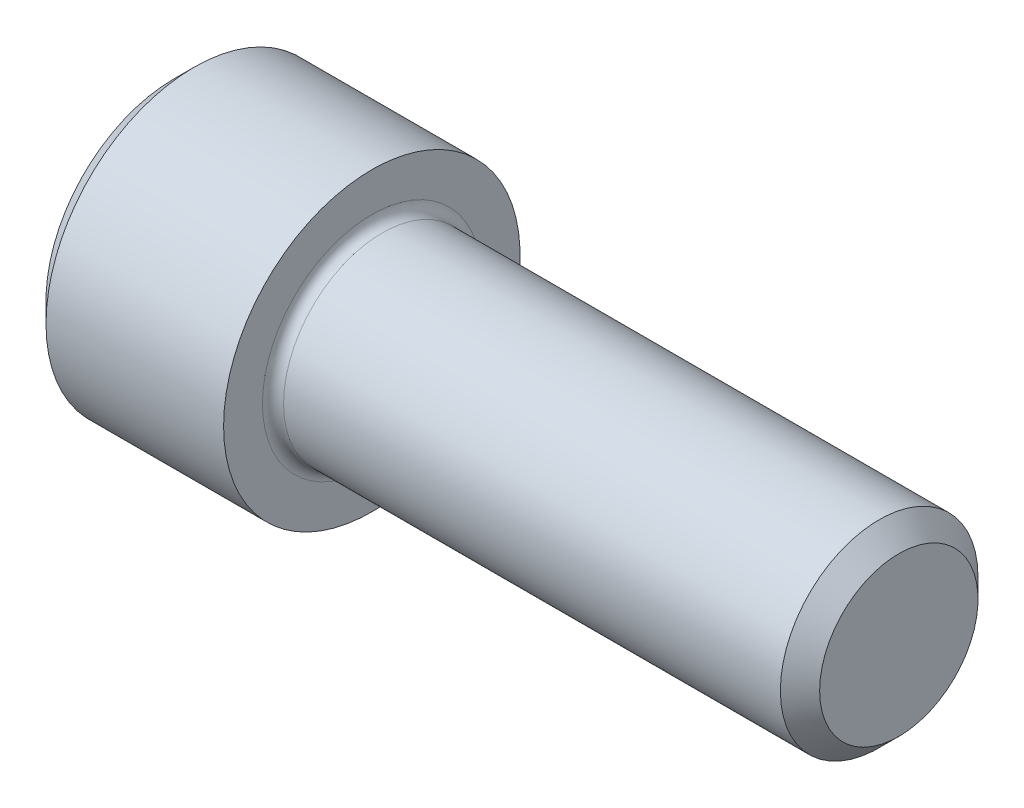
ISO-10303-21;
HEADER;
FILE_DESCRIPTION(('STEP AP214'),'2;1');
FILE_NAME('part.step','',(''),(''),'','','');
FILE_SCHEMA(('AUTOMOTIVE_DESIGN { 1 0 10303 214 1 1 1 1 }'));
ENDSEC;
DATA;
#1=APPLICATION_CONTEXT('core data for automotive mechanical design processes');
#2=APPLICATION_PROTOCOL_DEFINITION('international standard','automotive_design',2000,#1);
#3=PRODUCT_CONTEXT('',#1,'mechanical');
#4=PRODUCT('Part','Part','',(#3));
#5=PRODUCT_RELATED_PRODUCT_CATEGORY('part','',(#4));
#6=PRODUCT_DEFINITION_FORMATION('','',#4);
#7=PRODUCT_DEFINITION_CONTEXT('part definition',#1,'design');
#8=PRODUCT_DEFINITION('design','',#6,#7);
#9=PRODUCT_DEFINITION_SHAPE('','',#8);
#10=(LENGTH_UNIT() NAMED_UNIT(*) SI_UNIT(.MILLI.,.METRE.));
#11=(NAMED_UNIT(*) PLANE_ANGLE_UNIT() SI_UNIT($,.RADIAN.));
#12=(NAMED_UNIT(*) SI_UNIT($,.STERADIAN.) SOLID_ANGLE_UNIT());
#13=UNCERTAINTY_MEASURE_WITH_UNIT(LENGTH_MEASURE(1.E-05),#10,'distance_accuracy_value','');
#14=(GEOMETRIC_REPRESENTATION_CONTEXT(3) GLOBAL_UNCERTAINTY_ASSIGNED_CONTEXT((#13)) GLOBAL_UNIT_ASSIGNED_CONTEXT((#10,
#11,#12)) REPRESENTATION_CONTEXT('',''));
#15=CARTESIAN_POINT('',(0.,0.,0.));
#16=DIRECTION('',(0.,0.,1.));
#17=DIRECTION('',(1.,0.,0.));
#18=AXIS2_PLACEMENT_3D('',#15,#16,#17);
#19=CARTESIAN_POINT('',(4.62279999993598,0.,0.));
#20=DIRECTION('',(-1.,0.,0.));
#21=DIRECTION('',(0.,0.,1.));
#22=AXIS2_PLACEMENT_3D('',#19,#20,#21);
#23=CONICAL_SURFACE('',#22,3.96875000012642,1.047197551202);
#24=CARTESIAN_POINT('',(6.91415888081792,0.,0.));
#25=VERTEX_POINT('',#24);
#26=VERTEX_LOOP('',#25);
#27=FACE_BOUND('',#26,.T.);
#28=CARTESIAN_POINT('',(4.62280000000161,0.,0.));
#29=DIRECTION('',(-1.,0.,0.));
#30=DIRECTION('',(0.,0.,1.));
#31=AXIS2_PLACEMENT_3D('',#28,#29,#30);
#32=CIRCLE('',#31,3.96875000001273);
#33=CARTESIAN_POINT('',(4.6227999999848,0.,3.9687500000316));
#34=VERTEX_POINT('',#33);
#35=CARTESIAN_POINT('',(4.62280000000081,-3.437038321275,1.98437500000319));
#36=VERTEX_POINT('',#35);
#37=EDGE_CURVE('E99',#34,#36,#32,.F.);
#38=ORIENTED_EDGE('',*,*,#37,.F.);
#39=CARTESIAN_POINT('',(4.62280000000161,0.,0.));
#40=DIRECTION('',(-1.,0.,0.));
#41=DIRECTION('',(0.,0.,1.));
#42=AXIS2_PLACEMENT_3D('',#39,#40,#41);
#43=CIRCLE('',#42,3.96875000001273);
#44=CARTESIAN_POINT('',(4.62280000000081,3.43703832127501,1.98437500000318));
#45=VERTEX_POINT('',#44);
#46=EDGE_CURVE('E96',#45,#34,#43,.F.);
#47=ORIENTED_EDGE('',*,*,#46,.F.);
#48=CARTESIAN_POINT('',(4.62280000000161,0.,0.));
#49=DIRECTION('',(-1.,0.,0.));
#50=DIRECTION('',(0.,0.,1.));
#51=AXIS2_PLACEMENT_3D('',#48,#49,#50);
#52=CIRCLE('',#51,3.96875000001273);
#53=CARTESIAN_POINT('',(4.62280000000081,3.437038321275,-1.98437500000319));
#54=VERTEX_POINT('',#53);
#55=EDGE_CURVE('E157',#54,#45,#52,.F.);
#56=ORIENTED_EDGE('',*,*,#55,.F.);
#57=CARTESIAN_POINT('',(4.62280000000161,0.,0.));
#58=DIRECTION('',(-1.,0.,0.));
#59=DIRECTION('',(0.,0.,1.));
#60=AXIS2_PLACEMENT_3D('',#57,#58,#59);
#61=CIRCLE('',#60,3.96875000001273);
#62=CARTESIAN_POINT('',(4.6227999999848,2.58829427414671E-13,-3.96875000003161));
#63=VERTEX_POINT('',#62);
#64=EDGE_CURVE('E154',#63,#54,#61,.F.);
#65=ORIENTED_EDGE('',*,*,#64,.F.);
#66=CARTESIAN_POINT('',(4.62280000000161,0.,0.));
#67=DIRECTION('',(-1.,0.,0.));
#68=DIRECTION('',(0.,0.,1.));
#69=AXIS2_PLACEMENT_3D('',#66,#67,#68);
#70=CIRCLE('',#69,3.96875000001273);
#71=CARTESIAN_POINT('',(4.62280000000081,-3.43703832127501,-1.98437500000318));
#72=VERTEX_POINT('',#71);
#73=EDGE_CURVE('E159',#72,#63,#70,.F.);
#74=ORIENTED_EDGE('',*,*,#73,.F.);
#75=CARTESIAN_POINT('',(4.62280000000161,0.,0.));
#76=DIRECTION('',(-1.,0.,0.));
#77=DIRECTION('',(0.,0.,1.));
#78=AXIS2_PLACEMENT_3D('',#75,#76,#77);
#79=CIRCLE('',#78,3.96875000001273);
#80=EDGE_CURVE('E102',#36,#72,#79,.F.);
#81=ORIENTED_EDGE('',*,*,#80,.F.);
#82=EDGE_LOOP('',(#38,#47,#56,#65,#74,#81));
#83=FACE_BOUND('',#82,.T.);
#84=ADVANCED_FACE('F17',(#27,#83),#23,.F.);
#85=CARTESIAN_POINT('',(4.6228,2.29135888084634,3.96874999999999));
#86=DIRECTION('',(-1.,0.,0.));
#87=DIRECTION('',(0.,0.,1.));
#88=AXIS2_PLACEMENT_3D('',#85,#86,#87);
#89=PLANE('',#88);
#90=DIRECTION('',(0.,-1.,0.));
#91=VECTOR('',#90,1.);
#92=CARTESIAN_POINT('',(4.6228,-2.29135888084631,3.96875));
#93=LINE('',#92,#91);
#94=CARTESIAN_POINT('',(4.6228,2.29135888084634,3.96874999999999));
#95=VERTEX_POINT('',#94);
#96=EDGE_CURVE('E114',#34,#95,#93,.F.);
#97=ORIENTED_EDGE('',*,*,#96,.T.);
#98=DIRECTION('',(0.,0.499999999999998,-0.86602540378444));
#99=VECTOR('',#98,1.);
#100=CARTESIAN_POINT('',(4.6228,4.58271776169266,0.));
#101=LINE('',#100,#99);
#102=EDGE_CURVE('E115',#45,#95,#101,.F.);
#103=ORIENTED_EDGE('',*,*,#102,.F.);
#104=ORIENTED_EDGE('',*,*,#46,.T.);
#105=EDGE_LOOP('',(#97,#103,#104));
#106=FACE_BOUND('',#105,.T.);
#107=ADVANCED_FACE('F119',(#106),#89,.T.);
#108=CARTESIAN_POINT('',(4.6228,2.29135888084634,3.96874999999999));
#109=DIRECTION('',(-1.,0.,0.));
#110=DIRECTION('',(0.,0.,1.));
#111=AXIS2_PLACEMENT_3D('',#108,#109,#110);
#112=PLANE('',#111);
#113=DIRECTION('',(0.,0.500000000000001,0.866025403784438));
#114=VECTOR('',#113,1.);
#115=CARTESIAN_POINT('',(4.6228,-2.29135888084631,3.96875));
#116=LINE('',#115,#114);
#117=CARTESIAN_POINT('',(4.6228,-2.29135888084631,3.96875));
#118=VERTEX_POINT('',#117);
#119=EDGE_CURVE('E110',#118,#36,#116,.F.);
#120=ORIENTED_EDGE('',*,*,#119,.F.);
#121=DIRECTION('',(0.,-1.,0.));
#122=VECTOR('',#121,1.);
#123=CARTESIAN_POINT('',(4.6228,-2.29135888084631,3.96875));
#124=LINE('',#123,#122);
#125=EDGE_CURVE('E107',#118,#34,#124,.F.);
#126=ORIENTED_EDGE('',*,*,#125,.T.);
#127=ORIENTED_EDGE('',*,*,#37,.T.);
#128=EDGE_LOOP('',(#120,#126,#127));
#129=FACE_BOUND('',#128,.T.);
#130=ADVANCED_FACE('F108',(#129),#112,.T.);
#131=CARTESIAN_POINT('',(4.6228,2.29135888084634,3.96874999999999));
#132=DIRECTION('',(-1.,0.,0.));
#133=DIRECTION('',(0.,0.,1.));
#134=AXIS2_PLACEMENT_3D('',#131,#132,#133);
#135=PLANE('',#134);
#136=DIRECTION('',(0.,-0.499999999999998,0.86602540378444));
#137=VECTOR('',#136,1.);
#138=CARTESIAN_POINT('',(4.6228,-4.58271776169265,0.));
#139=LINE('',#138,#137);
#140=CARTESIAN_POINT('',(4.6228,-4.58271776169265,0.));
#141=VERTEX_POINT('',#140);
#142=EDGE_CURVE('E416',#141,#72,#139,.F.);
#143=ORIENTED_EDGE('',*,*,#142,.F.);
#144=DIRECTION('',(0.,0.500000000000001,0.866025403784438));
#145=VECTOR('',#144,1.);
#146=CARTESIAN_POINT('',(4.6228,-2.29135888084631,3.96875));
#147=LINE('',#146,#145);
#148=EDGE_CURVE('E418',#36,#141,#147,.F.);
#149=ORIENTED_EDGE('',*,*,#148,.F.);
#150=ORIENTED_EDGE('',*,*,#80,.T.);
#151=EDGE_LOOP('',(#143,#149,#150));
#152=FACE_BOUND('',#151,.T.);
#153=ADVANCED_FACE('F278',(#152),#135,.T.);
#154=CARTESIAN_POINT('',(4.6228,2.29135888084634,3.96874999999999));
#155=DIRECTION('',(-1.,0.,0.));
#156=DIRECTION('',(0.,0.,1.));
#157=AXIS2_PLACEMENT_3D('',#154,#155,#156);
#158=PLANE('',#157);
#159=DIRECTION('',(0.,1.,0.));
#160=VECTOR('',#159,1.);
#161=CARTESIAN_POINT('',(4.6228,2.29135888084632,-3.96875000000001));
#162=LINE('',#161,#160);
#163=CARTESIAN_POINT('',(4.6228,-2.29135888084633,-3.96875));
#164=VERTEX_POINT('',#163);
#165=EDGE_CURVE('E472',#63,#164,#162,.F.);
#166=ORIENTED_EDGE('',*,*,#165,.T.);
#167=DIRECTION('',(0.,-0.499999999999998,0.86602540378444));
#168=VECTOR('',#167,1.);
#169=CARTESIAN_POINT('',(4.6228,-4.58271776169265,0.));
#170=LINE('',#169,#168);
#171=EDGE_CURVE('E421',#72,#164,#170,.F.);
#172=ORIENTED_EDGE('',*,*,#171,.F.);
#173=ORIENTED_EDGE('',*,*,#73,.T.);
#174=EDGE_LOOP('',(#166,#172,#173));
#175=FACE_BOUND('',#174,.T.);
#176=ADVANCED_FACE('F274',(#175),#158,.T.);
#177=CARTESIAN_POINT('',(4.6228,2.29135888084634,3.96874999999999));
#178=DIRECTION('',(-1.,0.,0.));
#179=DIRECTION('',(0.,0.,1.));
#180=AXIS2_PLACEMENT_3D('',#177,#178,#179);
#181=PLANE('',#180);
#182=DIRECTION('',(0.,0.499999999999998,-0.86602540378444));
#183=VECTOR('',#182,1.);
#184=CARTESIAN_POINT('',(4.6228,4.58271776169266,0.));
#185=LINE('',#184,#183);
#186=CARTESIAN_POINT('',(4.6228,4.58271776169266,0.));
#187=VERTEX_POINT('',#186);
#188=EDGE_CURVE('E137',#187,#45,#185,.F.);
#189=ORIENTED_EDGE('',*,*,#188,.F.);
#190=DIRECTION('',(0.,0.500000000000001,0.866025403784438));
#191=VECTOR('',#190,1.);
#192=CARTESIAN_POINT('',(4.6228,4.58271776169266,0.));
#193=LINE('',#192,#191);
#194=EDGE_CURVE('E487',#187,#54,#193,.F.);
#195=ORIENTED_EDGE('',*,*,#194,.T.);
#196=ORIENTED_EDGE('',*,*,#55,.T.);
#197=EDGE_LOOP('',(#189,#195,#196));
#198=FACE_BOUND('',#197,.T.);
#199=ADVANCED_FACE('F270',(#198),#181,.T.);
#200=CARTESIAN_POINT('',(4.6228,2.29135888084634,3.96874999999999));
#201=DIRECTION('',(-1.,0.,0.));
#202=DIRECTION('',(0.,0.,1.));
#203=AXIS2_PLACEMENT_3D('',#200,#201,#202);
#204=PLANE('',#203);
#205=DIRECTION('',(0.,0.500000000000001,0.866025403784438));
#206=VECTOR('',#205,1.);
#207=CARTESIAN_POINT('',(4.6228,4.58271776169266,0.));
#208=LINE('',#207,#206);
#209=CARTESIAN_POINT('',(4.6228,2.29135888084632,-3.96875000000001));
#210=VERTEX_POINT('',#209);
#211=EDGE_CURVE('E461',#54,#210,#208,.F.);
#212=ORIENTED_EDGE('',*,*,#211,.T.);
#213=DIRECTION('',(0.,1.,0.));
#214=VECTOR('',#213,1.);
#215=CARTESIAN_POINT('',(4.6228,2.29135888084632,-3.96875000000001));
#216=LINE('',#215,#214);
#217=EDGE_CURVE('E475',#210,#63,#216,.F.);
#218=ORIENTED_EDGE('',*,*,#217,.T.);
#219=ORIENTED_EDGE('',*,*,#64,.T.);
#220=EDGE_LOOP('',(#212,#218,#219));
#221=FACE_BOUND('',#220,.T.);
#222=ADVANCED_FACE('F266',(#221),#204,.T.);
#223=CARTESIAN_POINT('',(4.6228,4.58271776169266,0.));
#224=DIRECTION('',(0.,-0.86602540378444,-0.499999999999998));
#225=DIRECTION('',(0.,0.499999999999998,-0.86602540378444));
#226=AXIS2_PLACEMENT_3D('',#223,#224,#225);
#227=PLANE('',#226);
#228=ORIENTED_EDGE('',*,*,#102,.T.);
#229=DIRECTION('',(1.,0.,0.));
#230=VECTOR('',#229,1.);
#231=CARTESIAN_POINT('',(4.6228,2.29135888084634,3.96874999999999));
#232=LINE('',#231,#230);
#233=CARTESIAN_POINT('',(0.,2.29135888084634,3.96874999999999));
#234=VERTEX_POINT('',#233);
#235=EDGE_CURVE('E126',#95,#234,#232,.F.);
#236=ORIENTED_EDGE('',*,*,#235,.T.);
#237=DIRECTION('',(0.,-0.499999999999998,0.86602540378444));
#238=VECTOR('',#237,1.);
#239=CARTESIAN_POINT('',(0.,4.58271776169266,0.));
#240=LINE('',#239,#238);
#241=CARTESIAN_POINT('',(0.,4.58271776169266,0.));
#242=VERTEX_POINT('',#241);
#243=EDGE_CURVE('E455',#242,#234,#240,.T.);
#244=ORIENTED_EDGE('',*,*,#243,.F.);
#245=DIRECTION('',(1.,0.,0.));
#246=VECTOR('',#245,1.);
#247=CARTESIAN_POINT('',(4.6228,4.58271776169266,0.));
#248=LINE('',#247,#246);
#249=EDGE_CURVE('E482',#242,#187,#248,.T.);
#250=ORIENTED_EDGE('',*,*,#249,.T.);
#251=ORIENTED_EDGE('',*,*,#188,.T.);
#252=EDGE_LOOP('',(#228,#236,#244,#250,#251));
#253=FACE_BOUND('',#252,.T.);
#254=ADVANCED_FACE('F263',(#253),#227,.T.);
#255=CARTESIAN_POINT('',(4.6228,-2.29135888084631,3.96875));
#256=DIRECTION('',(0.,0.,1.));
#257=DIRECTION('',(0.,-1.,0.));
#258=AXIS2_PLACEMENT_3D('',#255,#256,#257);
#259=PLANE('',#258);
#260=ORIENTED_EDGE('',*,*,#235,.F.);
#261=ORIENTED_EDGE('',*,*,#96,.F.);
#262=ORIENTED_EDGE('',*,*,#125,.F.);
#263=DIRECTION('',(1.,0.,0.));
#264=VECTOR('',#263,1.);
#265=CARTESIAN_POINT('',(4.6228,-2.29135888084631,3.96875));
#266=LINE('',#265,#264);
#267=CARTESIAN_POINT('',(0.,-2.29135888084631,3.96875));
#268=VERTEX_POINT('',#267);
#269=EDGE_CURVE('E128',#268,#118,#266,.T.);
#270=ORIENTED_EDGE('',*,*,#269,.F.);
#271=DIRECTION('',(0.,1.,0.));
#272=VECTOR('',#271,1.);
#273=CARTESIAN_POINT('',(0.,0.,3.96874999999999));
#274=LINE('',#273,#272);
#275=EDGE_CURVE('E444',#234,#268,#274,.F.);
#276=ORIENTED_EDGE('',*,*,#275,.F.);
#277=EDGE_LOOP('',(#260,#261,#262,#270,#276));
#278=FACE_BOUND('',#277,.T.);
#279=ADVANCED_FACE('F124',(#278),#259,.F.);
#280=CARTESIAN_POINT('',(4.6228,-2.29135888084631,3.96875));
#281=DIRECTION('',(0.,0.866025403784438,-0.500000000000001));
#282=DIRECTION('',(0.,0.500000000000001,0.866025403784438));
#283=AXIS2_PLACEMENT_3D('',#280,#281,#282);
#284=PLANE('',#283);
#285=ORIENTED_EDGE('',*,*,#148,.T.);
#286=DIRECTION('',(1.,0.,0.));
#287=VECTOR('',#286,1.);
#288=CARTESIAN_POINT('',(4.6228,-4.58271776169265,0.));
#289=LINE('',#288,#287);
#290=CARTESIAN_POINT('',(0.,-4.58271776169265,0.));
#291=VERTEX_POINT('',#290);
#292=EDGE_CURVE('E422',#291,#141,#289,.T.);
#293=ORIENTED_EDGE('',*,*,#292,.F.);
#294=DIRECTION('',(0.,-0.500000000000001,-0.866025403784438));
#295=VECTOR('',#294,1.);
#296=CARTESIAN_POINT('',(0.,-2.29135888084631,3.96875));
#297=LINE('',#296,#295);
#298=EDGE_CURVE('E440',#268,#291,#297,.T.);
#299=ORIENTED_EDGE('',*,*,#298,.F.);
#300=ORIENTED_EDGE('',*,*,#269,.T.);
#301=ORIENTED_EDGE('',*,*,#119,.T.);
#302=EDGE_LOOP('',(#285,#293,#299,#300,#301));
#303=FACE_BOUND('',#302,.T.);
#304=ADVANCED_FACE('F256',(#303),#284,.T.);
#305=CARTESIAN_POINT('',(4.6228,-4.58271776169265,0.));
#306=DIRECTION('',(0.,0.86602540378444,0.499999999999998));
#307=DIRECTION('',(0.,-0.499999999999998,0.86602540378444));
#308=AXIS2_PLACEMENT_3D('',#305,#306,#307);
#309=PLANE('',#308);
#310=ORIENTED_EDGE('',*,*,#171,.T.);
#311=DIRECTION('',(1.,0.,0.));
#312=VECTOR('',#311,1.);
#313=CARTESIAN_POINT('',(4.6228,-2.29135888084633,-3.96875));
#314=LINE('',#313,#312);
#315=CARTESIAN_POINT('',(0.,-2.29135888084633,-3.96875));
#316=VERTEX_POINT('',#315);
#317=EDGE_CURVE('E474',#164,#316,#314,.F.);
#318=ORIENTED_EDGE('',*,*,#317,.T.);
#319=DIRECTION('',(0.,0.499999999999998,-0.86602540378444));
#320=VECTOR('',#319,1.);
#321=CARTESIAN_POINT('',(0.,-4.58271776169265,0.));
#322=LINE('',#321,#320);
#323=EDGE_CURVE('E426',#291,#316,#322,.T.);
#324=ORIENTED_EDGE('',*,*,#323,.F.);
#325=ORIENTED_EDGE('',*,*,#292,.T.);
#326=ORIENTED_EDGE('',*,*,#142,.T.);
#327=EDGE_LOOP('',(#310,#318,#324,#325,#326));
#328=FACE_BOUND('',#327,.T.);
#329=ADVANCED_FACE('F252',(#328),#309,.T.);
#330=CARTESIAN_POINT('',(4.6228,2.29135888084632,-3.96875000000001));
#331=DIRECTION('',(0.,0.,-1.));
#332=DIRECTION('',(0.,1.,0.));
#333=AXIS2_PLACEMENT_3D('',#330,#331,#332);
#334=PLANE('',#333);
#335=ORIENTED_EDGE('',*,*,#317,.F.);
#336=ORIENTED_EDGE('',*,*,#165,.F.);
#337=ORIENTED_EDGE('',*,*,#217,.F.);
#338=DIRECTION('',(1.,0.,0.));
#339=VECTOR('',#338,1.);
#340=CARTESIAN_POINT('',(4.6228,2.29135888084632,-3.96875000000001));
#341=LINE('',#340,#339);
#342=CARTESIAN_POINT('',(0.,2.29135888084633,-3.96875));
#343=VERTEX_POINT('',#342);
#344=EDGE_CURVE('E458',#210,#343,#341,.F.);
#345=ORIENTED_EDGE('',*,*,#344,.T.);
#346=DIRECTION('',(0.,1.,0.));
#347=VECTOR('',#346,1.);
#348=CARTESIAN_POINT('',(0.,0.,-3.96875));
#349=LINE('',#348,#347);
#350=EDGE_CURVE('E439',#316,#343,#349,.T.);
#351=ORIENTED_EDGE('',*,*,#350,.F.);
#352=EDGE_LOOP('',(#335,#336,#337,#345,#351));
#353=FACE_BOUND('',#352,.T.);
#354=ADVANCED_FACE('F248',(#353),#334,.F.);
#355=CARTESIAN_POINT('',(4.6228,4.58271776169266,0.));
#356=DIRECTION('',(0.,0.866025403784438,-0.500000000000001));
#357=DIRECTION('',(0.,0.500000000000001,0.866025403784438));
#358=AXIS2_PLACEMENT_3D('',#355,#356,#357);
#359=PLANE('',#358);
#360=ORIENTED_EDGE('',*,*,#344,.F.);
#361=ORIENTED_EDGE('',*,*,#211,.F.);
#362=ORIENTED_EDGE('',*,*,#194,.F.);
#363=ORIENTED_EDGE('',*,*,#249,.F.);
#364=DIRECTION('',(0.,0.500000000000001,0.866025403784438));
#365=VECTOR('',#364,1.);
#366=CARTESIAN_POINT('',(0.,2.29135888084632,-3.96875000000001));
#367=LINE('',#366,#365);
#368=EDGE_CURVE('E153',#343,#242,#367,.T.);
#369=ORIENTED_EDGE('',*,*,#368,.F.);
#370=EDGE_LOOP('',(#360,#361,#362,#363,#369));
#371=FACE_BOUND('',#370,.T.);
#372=ADVANCED_FACE('F244',(#371),#359,.F.);
#373=CARTESIAN_POINT('',(0.,0.,0.));
#374=DIRECTION('',(-1.,0.,0.));
#375=DIRECTION('',(0.,0.,1.));
#376=AXIS2_PLACEMENT_3D('',#373,#374,#375);
#377=PLANE('',#376);
#378=CARTESIAN_POINT('',(0.,0.,0.));
#379=DIRECTION('',(1.,0.,0.));
#380=DIRECTION('',(0.,1.,0.));
#381=AXIS2_PLACEMENT_3D('',#378,#379,#380);
#382=CIRCLE('',#381,6.17855000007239);
#383=CARTESIAN_POINT('',(0.,6.17855000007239,0.));
#384=VERTEX_POINT('',#383);
#385=EDGE_CURVE('E150',#384,#384,#382,.T.);
#386=ORIENTED_EDGE('',*,*,#385,.F.);
#387=EDGE_LOOP('',(#386));
#388=FACE_BOUND('',#387,.T.);
#389=ORIENTED_EDGE('',*,*,#350,.T.);
#390=ORIENTED_EDGE('',*,*,#368,.T.);
#391=ORIENTED_EDGE('',*,*,#243,.T.);
#392=ORIENTED_EDGE('',*,*,#275,.T.);
#393=ORIENTED_EDGE('',*,*,#298,.T.);
#394=ORIENTED_EDGE('',*,*,#323,.T.);
#395=EDGE_LOOP('',(#389,#390,#391,#392,#393,#394));
#396=FACE_BOUND('',#395,.T.);
#397=ADVANCED_FACE('F236',(#388,#396),#377,.T.);
#398=CARTESIAN_POINT('',(0.965199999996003,0.,0.));
#399=DIRECTION('',(1.,0.,0.));
#400=DIRECTION('',(0.,1.,0.));
#401=AXIS2_PLACEMENT_3D('',#398,#399,#400);
#402=CONICAL_SURFACE('',#401,7.14375000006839,0.785398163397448);
#403=ORIENTED_EDGE('',*,*,#385,.T.);
#404=EDGE_LOOP('',(#403));
#405=FACE_BOUND('',#404,.T.);
#406=CARTESIAN_POINT('',(0.965199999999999,0.,0.));
#407=DIRECTION('',(-1.,0.,0.));
#408=DIRECTION('',(0.,0.,1.));
#409=AXIS2_PLACEMENT_3D('',#406,#407,#408);
#410=CIRCLE('',#409,7.14375);
#411=CARTESIAN_POINT('',(0.965199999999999,0.,7.14375));
#412=VERTEX_POINT('',#411);
#413=EDGE_CURVE('E149',#412,#412,#410,.F.);
#414=ORIENTED_EDGE('',*,*,#413,.F.);
#415=EDGE_LOOP('',(#414));
#416=FACE_BOUND('',#415,.T.);
#417=ADVANCED_FACE('F231',(#405,#416),#402,.T.);
#418=CARTESIAN_POINT('',(-31.75,0.,0.));
#419=DIRECTION('',(-1.,0.,0.));
#420=DIRECTION('',(0.,0.,1.));
#421=AXIS2_PLACEMENT_3D('',#418,#419,#420);
#422=CYLINDRICAL_SURFACE('',#421,7.14375);
#423=CARTESIAN_POINT('',(9.525,0.,0.));
#424=DIRECTION('',(-1.,0.,0.));
#425=DIRECTION('',(0.,0.,1.));
#426=AXIS2_PLACEMENT_3D('',#423,#424,#425);
#427=CIRCLE('',#426,7.14375);
#428=CARTESIAN_POINT('',(9.525,0.,7.14375));
#429=VERTEX_POINT('',#428);
#430=EDGE_CURVE('E146',#429,#429,#427,.F.);
#431=ORIENTED_EDGE('',*,*,#430,.F.);
#432=EDGE_LOOP('',(#431));
#433=FACE_BOUND('',#432,.T.);
#434=ORIENTED_EDGE('',*,*,#413,.T.);
#435=EDGE_LOOP('',(#434));
#436=FACE_BOUND('',#435,.T.);
#437=ADVANCED_FACE('F227',(#433,#436),#422,.T.);
#438=CARTESIAN_POINT('',(34.925,3.81635,0.));
#439=DIRECTION('',(1.,0.,0.));
#440=DIRECTION('',(0.,0.,-1.));
#441=AXIS2_PLACEMENT_3D('',#438,#439,#440);
#442=PLANE('',#441);
#443=CARTESIAN_POINT('',(34.924999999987,0.,0.));
#444=DIRECTION('',(-1.,0.,0.));
#445=DIRECTION('',(0.,0.,1.));
#446=AXIS2_PLACEMENT_3D('',#443,#444,#445);
#447=CIRCLE('',#446,3.8163499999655);
#448=CARTESIAN_POINT('',(34.924999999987,0.,3.8163499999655));
#449=VERTEX_POINT('',#448);
#450=EDGE_CURVE('E142',#449,#449,#447,.T.);
#451=ORIENTED_EDGE('',*,*,#450,.F.);
#452=EDGE_LOOP('',(#451));
#453=FACE_BOUND('',#452,.T.);
#454=ADVANCED_FACE('F185',(#453),#442,.T.);
#455=CARTESIAN_POINT('',(9.525,7.14375,0.));
#456=DIRECTION('',(1.,0.,0.));
#457=DIRECTION('',(0.,0.,-1.));
#458=AXIS2_PLACEMENT_3D('',#455,#456,#457);
#459=PLANE('',#458);
#460=ORIENTED_EDGE('',*,*,#430,.T.);
#461=EDGE_LOOP('',(#460));
#462=FACE_BOUND('',#461,.T.);
#463=CARTESIAN_POINT('',(9.525,0.,0.));
#464=DIRECTION('',(1.,0.,0.));
#465=DIRECTION('',(0.,0.,1.));
#466=AXIS2_PLACEMENT_3D('',#463,#464,#465);
#467=CIRCLE('',#466,5.2705);
#468=CARTESIAN_POINT('',(9.525,0.,-5.2705));
#469=VERTEX_POINT('',#468);
#470=CARTESIAN_POINT('',(9.525,0.,5.2705));
#471=VERTEX_POINT('',#470);
#472=EDGE_CURVE('E145',#469,#471,#467,.F.);
#473=ORIENTED_EDGE('',*,*,#472,.T.);
#474=CARTESIAN_POINT('',(9.525,0.,0.));
#475=DIRECTION('',(1.,0.,0.));
#476=DIRECTION('',(0.,0.,-1.));
#477=AXIS2_PLACEMENT_3D('',#474,#475,#476);
#478=CIRCLE('',#477,5.2705);
#479=EDGE_CURVE('E36',#471,#469,#478,.F.);
#480=ORIENTED_EDGE('',*,*,#479,.T.);
#481=EDGE_LOOP('',(#473,#480));
#482=FACE_BOUND('',#481,.T.);
#483=ADVANCED_FACE('F166',(#462,#482),#459,.T.);
#484=CARTESIAN_POINT('',(33.9788499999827,0.,0.));
#485=DIRECTION('',(-1.,0.,0.));
#486=DIRECTION('',(0.,0.,1.));
#487=AXIS2_PLACEMENT_3D('',#484,#485,#486);
#488=CONICAL_SURFACE('',#487,4.76250000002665,0.785398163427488);
#489=CARTESIAN_POINT('',(33.97885,0.,0.));
#490=DIRECTION('',(-1.,0.,0.));
#491=DIRECTION('',(0.,0.,1.));
#492=AXIS2_PLACEMENT_3D('',#489,#490,#491);
#493=CIRCLE('',#492,4.7625);
#494=CARTESIAN_POINT('',(33.97885,0.,4.7625));
#495=VERTEX_POINT('',#494);
#496=EDGE_CURVE('E28',#495,#495,#493,.T.);
#497=ORIENTED_EDGE('',*,*,#496,.F.);
#498=EDGE_LOOP('',(#497));
#499=FACE_BOUND('',#498,.T.);
#500=ORIENTED_EDGE('',*,*,#450,.T.);
#501=EDGE_LOOP('',(#500));
#502=FACE_BOUND('',#501,.T.);
#503=ADVANCED_FACE('F184',(#499,#502),#488,.T.);
#504=CARTESIAN_POINT('',(10.033,0.,0.));
#505=DIRECTION('',(1.,0.,0.));
#506=DIRECTION('',(0.,0.,-1.));
#507=AXIS2_PLACEMENT_3D('',#504,#505,#506);
#508=TOROIDAL_SURFACE('',#507,5.2705,0.508);
#509=CARTESIAN_POINT('',(10.033,0.,0.));
#510=DIRECTION('',(-1.,0.,0.));
#511=DIRECTION('',(0.,0.,1.));
#512=AXIS2_PLACEMENT_3D('',#509,#510,#511);
#513=CIRCLE('',#512,4.7625);
#514=CARTESIAN_POINT('',(10.033,0.,4.7625));
#515=VERTEX_POINT('',#514);
#516=EDGE_CURVE('E11',#515,#515,#513,.F.);
#517=ORIENTED_EDGE('',*,*,#516,.F.);
#518=EDGE_LOOP('',(#517));
#519=FACE_BOUND('',#518,.T.);
#520=ORIENTED_EDGE('',*,*,#472,.F.);
#521=ORIENTED_EDGE('',*,*,#479,.F.);
#522=EDGE_LOOP('',(#520,#521));
#523=FACE_BOUND('',#522,.T.);
#524=ADVANCED_FACE('F163',(#519,#523),#508,.F.);
#525=CARTESIAN_POINT('',(-31.75,0.,0.));
#526=DIRECTION('',(-1.,0.,0.));
#527=DIRECTION('',(0.,0.,1.));
#528=AXIS2_PLACEMENT_3D('',#525,#526,#527);
#529=CYLINDRICAL_SURFACE('',#528,4.7625);
#530=ORIENTED_EDGE('',*,*,#516,.T.);
#531=EDGE_LOOP('',(#530));
#532=FACE_BOUND('',#531,.T.);
#533=ORIENTED_EDGE('',*,*,#496,.T.);
#534=EDGE_LOOP('',(#533));
#535=FACE_BOUND('',#534,.T.);
#536=ADVANCED_FACE('F209',(#532,#535),#529,.T.);
#537=CLOSED_SHELL('',(#84,#107,#130,#153,#176,#199,#222,#254,#279,#304,#329,#354,#372,#397,#417,
#437,#454,#483,#503,#524,#536));
#538=MANIFOLD_SOLID_BREP('B1',#537);
#539=ADVANCED_BREP_SHAPE_REPRESENTATION('',(#18,#538),#14);
#540=SHAPE_DEFINITION_REPRESENTATION(#9,#539);
ENDSEC;
END-ISO-10303-21;
